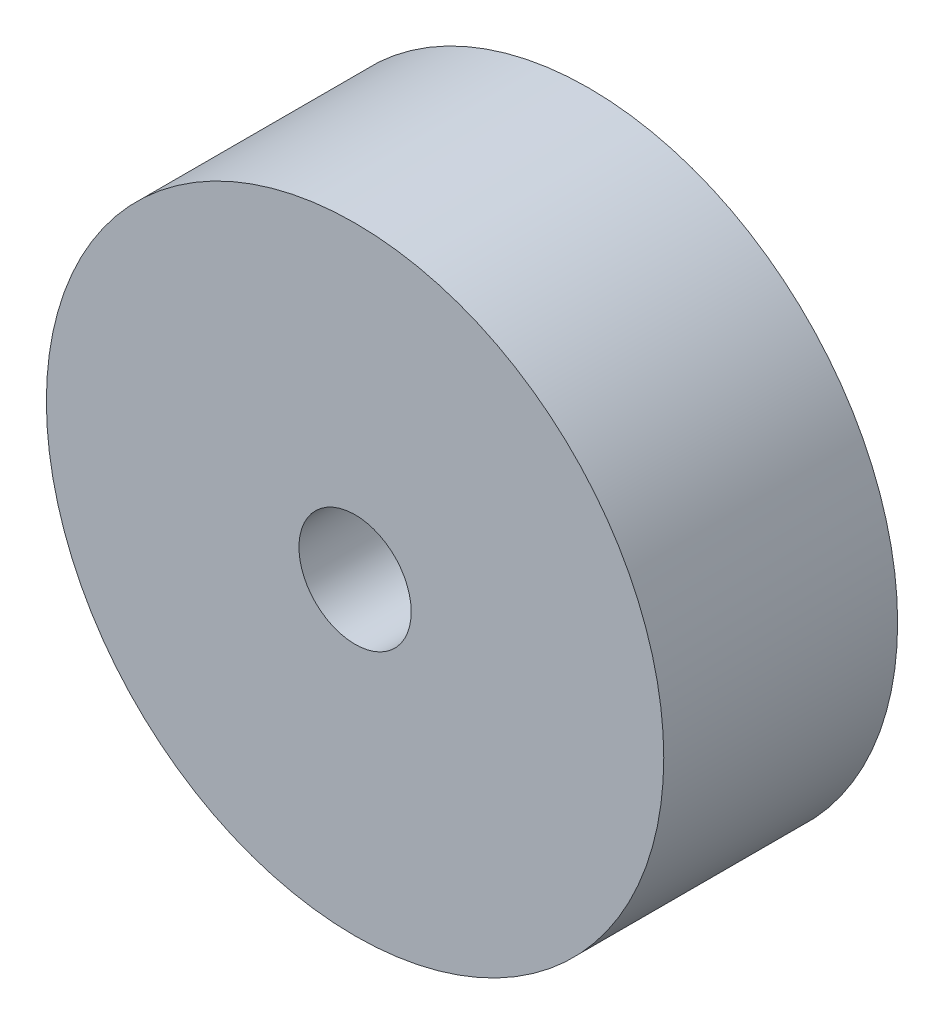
ISO-10303-21;
HEADER;
FILE_DESCRIPTION(('STEP AP214'),'2;1');
FILE_NAME('part.step','',(''),(''),'','','');
FILE_SCHEMA(('AUTOMOTIVE_DESIGN { 1 0 10303 214 1 1 1 1 }'));
ENDSEC;
DATA;
#1=APPLICATION_CONTEXT('core data for automotive mechanical design processes');
#2=APPLICATION_PROTOCOL_DEFINITION('international standard','automotive_design',2000,#1);
#3=PRODUCT_CONTEXT('',#1,'mechanical');
#4=PRODUCT('Part','Part','',(#3));
#5=PRODUCT_RELATED_PRODUCT_CATEGORY('part','',(#4));
#6=PRODUCT_DEFINITION_FORMATION('','',#4);
#7=PRODUCT_DEFINITION_CONTEXT('part definition',#1,'design');
#8=PRODUCT_DEFINITION('design','',#6,#7);
#9=PRODUCT_DEFINITION_SHAPE('','',#8);
#10=(LENGTH_UNIT() NAMED_UNIT(*) SI_UNIT(.MILLI.,.METRE.));
#11=(NAMED_UNIT(*) PLANE_ANGLE_UNIT() SI_UNIT($,.RADIAN.));
#12=(NAMED_UNIT(*) SI_UNIT($,.STERADIAN.) SOLID_ANGLE_UNIT());
#13=UNCERTAINTY_MEASURE_WITH_UNIT(LENGTH_MEASURE(1.E-05),#10,'distance_accuracy_value','');
#14=(GEOMETRIC_REPRESENTATION_CONTEXT(3) GLOBAL_UNCERTAINTY_ASSIGNED_CONTEXT((#13)) GLOBAL_UNIT_ASSIGNED_CONTEXT((#10,
#11,#12)) REPRESENTATION_CONTEXT('',''));
#15=CARTESIAN_POINT('',(0.,0.,0.));
#16=DIRECTION('',(0.,0.,1.));
#17=DIRECTION('',(1.,0.,0.));
#18=AXIS2_PLACEMENT_3D('',#15,#16,#17);
#19=CARTESIAN_POINT('',(0.,0.,-25.));
#20=DIRECTION('',(0.,0.,1.));
#21=DIRECTION('',(1.,0.,0.));
#22=AXIS2_PLACEMENT_3D('',#19,#20,#21);
#23=CYLINDRICAL_SURFACE('',#22,33.);
#24=CARTESIAN_POINT('',(0.,0.,-25.));
#25=DIRECTION('',(0.,0.,1.));
#26=DIRECTION('',(1.,0.,0.));
#27=AXIS2_PLACEMENT_3D('',#24,#25,#26);
#28=CIRCLE('',#27,33.);
#29=CARTESIAN_POINT('',(33.,0.,-25.));
#30=VERTEX_POINT('',#29);
#31=EDGE_CURVE('E10',#30,#30,#28,.T.);
#32=ORIENTED_EDGE('',*,*,#31,.T.);
#33=EDGE_LOOP('',(#32));
#34=FACE_BOUND('',#33,.T.);
#35=CARTESIAN_POINT('',(0.,0.,0.));
#36=DIRECTION('',(0.,0.,1.));
#37=DIRECTION('',(1.,0.,0.));
#38=AXIS2_PLACEMENT_3D('',#35,#36,#37);
#39=CIRCLE('',#38,33.);
#40=CARTESIAN_POINT('',(33.,0.,0.));
#41=VERTEX_POINT('',#40);
#42=EDGE_CURVE('E37',#41,#41,#39,.T.);
#43=ORIENTED_EDGE('',*,*,#42,.F.);
#44=EDGE_LOOP('',(#43));
#45=FACE_BOUND('',#44,.T.);
#46=ADVANCED_FACE('F40',(#34,#45),#23,.T.);
#47=CARTESIAN_POINT('',(0.,0.,-25.));
#48=DIRECTION('',(0.,0.,1.));
#49=DIRECTION('',(1.,0.,0.));
#50=AXIS2_PLACEMENT_3D('',#47,#48,#49);
#51=PLANE('',#50);
#52=CARTESIAN_POINT('',(0.,0.,-25.));
#53=DIRECTION('',(0.,0.,1.));
#54=DIRECTION('',(1.,0.,0.));
#55=AXIS2_PLACEMENT_3D('',#52,#53,#54);
#56=CIRCLE('',#55,6.);
#57=CARTESIAN_POINT('',(6.,0.,-25.));
#58=VERTEX_POINT('',#57);
#59=EDGE_CURVE('E50',#58,#58,#56,.T.);
#60=ORIENTED_EDGE('',*,*,#59,.T.);
#61=EDGE_LOOP('',(#60));
#62=FACE_BOUND('',#61,.T.);
#63=ORIENTED_EDGE('',*,*,#31,.F.);
#64=EDGE_LOOP('',(#63));
#65=FACE_BOUND('',#64,.T.);
#66=ADVANCED_FACE('F54',(#62,#65),#51,.F.);
#67=CARTESIAN_POINT('',(0.,0.,0.));
#68=DIRECTION('',(0.,0.,1.));
#69=DIRECTION('',(1.,0.,0.));
#70=AXIS2_PLACEMENT_3D('',#67,#68,#69);
#71=PLANE('',#70);
#72=CARTESIAN_POINT('',(0.,0.,0.));
#73=DIRECTION('',(0.,0.,1.));
#74=DIRECTION('',(1.,0.,0.));
#75=AXIS2_PLACEMENT_3D('',#72,#73,#74);
#76=CIRCLE('',#75,6.);
#77=CARTESIAN_POINT('',(6.,0.,0.));
#78=VERTEX_POINT('',#77);
#79=EDGE_CURVE('E47',#78,#78,#76,.T.);
#80=ORIENTED_EDGE('',*,*,#79,.F.);
#81=EDGE_LOOP('',(#80));
#82=FACE_BOUND('',#81,.T.);
#83=ORIENTED_EDGE('',*,*,#42,.T.);
#84=EDGE_LOOP('',(#83));
#85=FACE_BOUND('',#84,.T.);
#86=ADVANCED_FACE('F62',(#82,#85),#71,.T.);
#87=CARTESIAN_POINT('',(0.,0.,-25.));
#88=DIRECTION('',(0.,0.,1.));
#89=DIRECTION('',(1.,0.,0.));
#90=AXIS2_PLACEMENT_3D('',#87,#88,#89);
#91=CYLINDRICAL_SURFACE('',#90,6.);
#92=ORIENTED_EDGE('',*,*,#59,.F.);
#93=EDGE_LOOP('',(#92));
#94=FACE_BOUND('',#93,.T.);
#95=ORIENTED_EDGE('',*,*,#79,.T.);
#96=EDGE_LOOP('',(#95));
#97=FACE_BOUND('',#96,.T.);
#98=ADVANCED_FACE('F59',(#94,#97),#91,.F.);
#99=CLOSED_SHELL('',(#46,#66,#86,#98));
#100=MANIFOLD_SOLID_BREP('B2',#99);
#101=ADVANCED_BREP_SHAPE_REPRESENTATION('',(#18,#100),#14);
#102=SHAPE_DEFINITION_REPRESENTATION(#9,#101);
ENDSEC;
END-ISO-10303-21;
